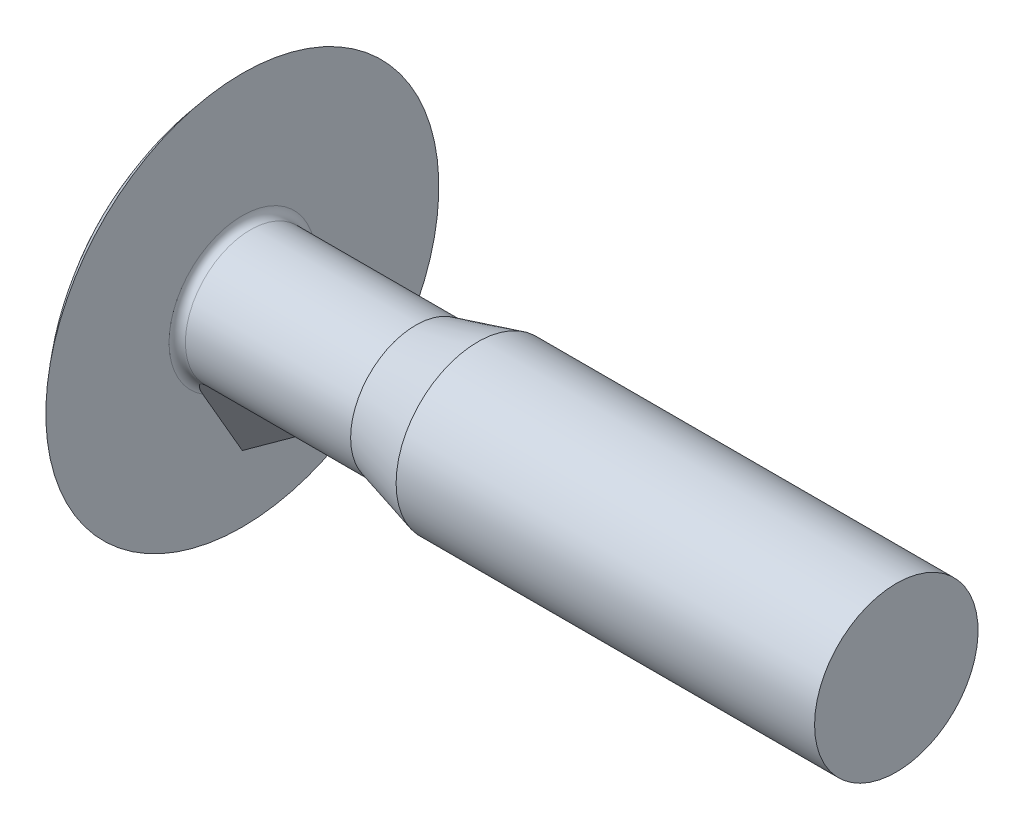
ISO-10303-21;
HEADER;
FILE_DESCRIPTION(('STEP AP214'),'2;1');
FILE_NAME('part.step','',(''),(''),'','','');
FILE_SCHEMA(('AUTOMOTIVE_DESIGN { 1 0 10303 214 1 1 1 1 }'));
ENDSEC;
DATA;
#1=APPLICATION_CONTEXT('core data for automotive mechanical design processes');
#2=APPLICATION_PROTOCOL_DEFINITION('international standard','automotive_design',2000,#1);
#3=PRODUCT_CONTEXT('',#1,'mechanical');
#4=PRODUCT('Part','Part','',(#3));
#5=PRODUCT_RELATED_PRODUCT_CATEGORY('part','',(#4));
#6=PRODUCT_DEFINITION_FORMATION('','',#4);
#7=PRODUCT_DEFINITION_CONTEXT('part definition',#1,'design');
#8=PRODUCT_DEFINITION('design','',#6,#7);
#9=PRODUCT_DEFINITION_SHAPE('','',#8);
#10=(LENGTH_UNIT() NAMED_UNIT(*) SI_UNIT(.MILLI.,.METRE.));
#11=(NAMED_UNIT(*) PLANE_ANGLE_UNIT() SI_UNIT($,.RADIAN.));
#12=(NAMED_UNIT(*) SI_UNIT($,.STERADIAN.) SOLID_ANGLE_UNIT());
#13=UNCERTAINTY_MEASURE_WITH_UNIT(LENGTH_MEASURE(1.E-05),#10,'distance_accuracy_value','');
#14=(GEOMETRIC_REPRESENTATION_CONTEXT(3) GLOBAL_UNCERTAINTY_ASSIGNED_CONTEXT((#13)) GLOBAL_UNIT_ASSIGNED_CONTEXT((#10,
#11,#12)) REPRESENTATION_CONTEXT('',''));
#15=CARTESIAN_POINT('',(0.,0.,0.));
#16=DIRECTION('',(0.,0.,1.));
#17=DIRECTION('',(1.,0.,0.));
#18=AXIS2_PLACEMENT_3D('',#15,#16,#17);
#19=CARTESIAN_POINT('',(4.6,0.,0.));
#20=DIRECTION('',(1.,0.,0.));
#21=DIRECTION('',(0.,1.,0.));
#22=AXIS2_PLACEMENT_3D('',#19,#20,#21);
#23=PLANE('',#22);
#24=CARTESIAN_POINT('',(4.59999999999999,0.,0.));
#25=DIRECTION('',(-1.,0.,0.));
#26=DIRECTION('',(0.,-1.,0.));
#27=AXIS2_PLACEMENT_3D('',#24,#25,#26);
#28=CIRCLE('',#27,12.0183193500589);
#29=CARTESIAN_POINT('',(4.6,-12.0183193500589,0.));
#30=VERTEX_POINT('',#29);
#31=EDGE_CURVE('E87',#30,#30,#28,.T.);
#32=ORIENTED_EDGE('',*,*,#31,.F.);
#33=EDGE_LOOP('',(#32));
#34=FACE_BOUND('',#33,.T.);
#35=CARTESIAN_POINT('',(4.6,0.,0.));
#36=DIRECTION('',(1.,0.,0.));
#37=DIRECTION('',(0.,1.,0.));
#38=AXIS2_PLACEMENT_3D('',#35,#36,#37);
#39=CIRCLE('',#38,4.48179306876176);
#40=CARTESIAN_POINT('',(4.59999999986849,-3.77242531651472,2.41976782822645));
#41=VERTEX_POINT('',#40);
#42=CARTESIAN_POINT('',(4.6,-3.77242531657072,-2.41976782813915));
#43=VERTEX_POINT('',#42);
#44=EDGE_CURVE('E83',#41,#43,#39,.F.);
#45=ORIENTED_EDGE('',*,*,#44,.T.);
#46=DIRECTION('',(0.,0.86602540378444,-0.499999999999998));
#47=VECTOR('',#46,1.);
#48=CARTESIAN_POINT('',(4.59999999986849,-1.99089653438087,-3.44833395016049));
#49=LINE('',#48,#47);
#50=CARTESIAN_POINT('',(4.6,-7.96358613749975,-4.12300402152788E-11));
#51=VERTEX_POINT('',#50);
#52=EDGE_CURVE('E62',#51,#43,#49,.T.);
#53=ORIENTED_EDGE('',*,*,#52,.F.);
#54=DIRECTION('',(0.,-0.866025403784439,-0.499999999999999));
#55=VECTOR('',#54,1.);
#56=CARTESIAN_POINT('',(4.59999999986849,-7.96358613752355,0.));
#57=LINE('',#56,#55);
#58=EDGE_CURVE('E89',#41,#51,#57,.T.);
#59=ORIENTED_EDGE('',*,*,#58,.F.);
#60=EDGE_LOOP('',(#45,#53,#59));
#61=FACE_BOUND('',#60,.T.);
#62=ADVANCED_FACE('F44',(#34,#61),#23,.T.);
#63=CARTESIAN_POINT('',(-22.0180027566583,0.,0.));
#64=DIRECTION('',(-1.,0.,0.));
#65=DIRECTION('',(0.,0.,1.));
#66=AXIS2_PLACEMENT_3D('',#63,#64,#65);
#67=CYLINDRICAL_SURFACE('',#66,3.98179306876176);
#68=CARTESIAN_POINT('',(15.206,0.,0.));
#69=DIRECTION('',(-1.,0.,0.));
#70=DIRECTION('',(0.,0.,1.));
#71=AXIS2_PLACEMENT_3D('',#68,#69,#70);
#72=CIRCLE('',#71,3.98179306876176);
#73=CARTESIAN_POINT('',(15.206,0.,3.98179306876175));
#74=VERTEX_POINT('',#73);
#75=EDGE_CURVE('E142',#74,#74,#72,.T.);
#76=ORIENTED_EDGE('',*,*,#75,.T.);
#77=EDGE_LOOP('',(#76));
#78=FACE_BOUND('',#77,.T.);
#79=CARTESIAN_POINT('',(15.6000000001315,0.,0.));
#80=DIRECTION('',(-0.340368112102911,0.470146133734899,-0.814316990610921));
#81=DIRECTION('',(-0.940292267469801,-0.170184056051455,0.294767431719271));
#82=AXIS2_PLACEMENT_3D('',#79,#80,#81);
#83=ELLIPSE('',#82,11.698490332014,3.98179306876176);
#84=CARTESIAN_POINT('',(5.1,-2.92823023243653,2.69817415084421));
#85=VERTEX_POINT('',#84);
#86=CARTESIAN_POINT('',(10.1,-3.98179306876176,0.));
#87=VERTEX_POINT('',#86);
#88=EDGE_CURVE('E70',#85,#87,#83,.F.);
#89=ORIENTED_EDGE('',*,*,#88,.T.);
#90=CARTESIAN_POINT('',(15.6000000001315,0.,0.));
#91=DIRECTION('',(-0.340368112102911,0.470146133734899,0.814316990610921));
#92=DIRECTION('',(-0.940292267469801,-0.170184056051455,-0.294767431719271));
#93=AXIS2_PLACEMENT_3D('',#90,#91,#92);
#94=ELLIPSE('',#93,11.698490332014,3.98179306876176);
#95=CARTESIAN_POINT('',(5.1,-2.92823023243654,-2.69817415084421));
#96=VERTEX_POINT('',#95);
#97=EDGE_CURVE('E151',#87,#96,#94,.F.);
#98=ORIENTED_EDGE('',*,*,#97,.T.);
#99=CARTESIAN_POINT('',(5.1,0.,0.));
#100=DIRECTION('',(1.,0.,0.));
#101=DIRECTION('',(0.,1.,0.));
#102=AXIS2_PLACEMENT_3D('',#99,#100,#101);
#103=CIRCLE('',#102,3.98179306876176);
#104=EDGE_CURVE('E86',#96,#85,#103,.T.);
#105=ORIENTED_EDGE('',*,*,#104,.T.);
#106=EDGE_LOOP('',(#89,#98,#105));
#107=FACE_BOUND('',#106,.T.);
#108=ADVANCED_FACE('F119',(#78,#107),#67,.T.);
#109=CARTESIAN_POINT('',(5.1,0.,0.));
#110=DIRECTION('',(1.,0.,0.));
#111=DIRECTION('',(0.,1.,0.));
#112=AXIS2_PLACEMENT_3D('',#109,#110,#111);
#113=TOROIDAL_SURFACE('',#112,4.48179306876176,0.5);
#114=CARTESIAN_POINT('',(4.79641919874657,-4.48199306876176,-1.92799942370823));
#115=CARTESIAN_POINT('',(4.77904627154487,-4.45857969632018,-1.94877867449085));
#116=CARTESIAN_POINT('',(4.76308963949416,-4.43416257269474,-1.9695454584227));
#117=CARTESIAN_POINT('',(4.73380687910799,-4.38373895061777,-2.01089715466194));
#118=CARTESIAN_POINT('',(4.7204758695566,-4.3577355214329,-2.03148233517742));
#119=CARTESIAN_POINT('',(4.6962596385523,-4.30464400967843,-2.07225663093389));
#120=CARTESIAN_POINT('',(4.68535872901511,-4.27756429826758,-2.09244747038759));
#121=CARTESIAN_POINT('',(4.66570368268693,-4.22239116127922,-2.13251710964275));
#122=CARTESIAN_POINT('',(4.65695097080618,-4.19429707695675,-2.15239569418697));
#123=CARTESIAN_POINT('',(4.63698380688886,-4.12092333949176,-2.20310391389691));
#124=CARTESIAN_POINT('',(4.62724669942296,-4.07504856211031,-2.23365964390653));
#125=CARTESIAN_POINT('',(4.61224277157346,-3.9818925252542,-2.29371464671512));
#126=CARTESIAN_POINT('',(4.6069782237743,-3.93461056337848,-2.32321337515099));
#127=CARTESIAN_POINT('',(4.60055978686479,-3.83883848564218,-2.38119018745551));
#128=CARTESIAN_POINT('',(4.59942607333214,-3.79034360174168,-2.40966259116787));
#129=CARTESIAN_POINT('',(4.60110679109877,-3.69272553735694,-2.46531990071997));
#130=CARTESIAN_POINT('',(4.60391972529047,-3.64360260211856,-2.49250529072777));
#131=CARTESIAN_POINT('',(4.61453000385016,-3.53336939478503,-2.55171357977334));
#132=CARTESIAN_POINT('',(4.62334290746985,-3.47215360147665,-2.58337291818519));
#133=CARTESIAN_POINT('',(4.6412877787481,-3.3804367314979,-2.62882508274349));
#134=CARTESIAN_POINT('',(4.64803843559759,-3.34994434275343,-2.6436082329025));
#135=CARTESIAN_POINT('',(4.66328169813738,-3.28903358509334,-2.67240369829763));
#136=CARTESIAN_POINT('',(4.67177366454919,-3.25861519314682,-2.68641629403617));
#137=CARTESIAN_POINT('',(4.68860134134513,-3.20499818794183,-2.71033845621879));
#138=CARTESIAN_POINT('',(4.69651872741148,-3.18175728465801,-2.72044728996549));
#139=CARTESIAN_POINT('',(4.71384045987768,-3.13542049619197,-2.73995971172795));
#140=CARTESIAN_POINT('',(4.7232495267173,-3.11232532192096,-2.7493609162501));
#141=CARTESIAN_POINT('',(4.74450661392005,-3.06535377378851,-2.76759491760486));
#142=CARTESIAN_POINT('',(4.75645836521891,-3.04150192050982,-2.77637020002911));
#143=CARTESIAN_POINT('',(4.78332211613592,-2.99489219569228,-2.79205183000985));
#144=CARTESIAN_POINT('',(4.79821581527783,-2.97212859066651,-2.79896913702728));
#145=CARTESIAN_POINT('',(4.82147276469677,-2.94343777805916,-2.80581284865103));
#146=CARTESIAN_POINT('',(4.82774452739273,-2.93622806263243,-2.80735390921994));
#147=CARTESIAN_POINT('',(4.84098870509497,-2.9223405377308,-2.80983607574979));
#148=CARTESIAN_POINT('',(4.84796186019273,-2.91566330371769,-2.81077654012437));
#149=CARTESIAN_POINT('',(4.86278855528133,-2.90304121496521,-2.81186664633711));
#150=CARTESIAN_POINT('',(4.87065294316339,-2.89710777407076,-2.81200516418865));
#151=CARTESIAN_POINT('',(4.88715611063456,-2.88653490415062,-2.81121142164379));
#152=CARTESIAN_POINT('',(4.89579208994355,-2.88189102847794,-2.81028289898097));
#153=CARTESIAN_POINT('',(4.91135868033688,-2.87529302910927,-2.80758573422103));
#154=CARTESIAN_POINT('',(4.91817376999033,-2.87295641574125,-2.80608620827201));
#155=CARTESIAN_POINT('',(4.93190908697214,-2.86936990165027,-2.80241579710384));
#156=CARTESIAN_POINT('',(4.93882931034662,-2.86811996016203,-2.80024493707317));
#157=CARTESIAN_POINT('',(4.95253673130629,-2.8666919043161,-2.79533999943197));
#158=CARTESIAN_POINT('',(4.95932439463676,-2.86650888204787,-2.79260856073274));
#159=CARTESIAN_POINT('',(4.97266156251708,-2.8670732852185,-2.78670803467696));
#160=CARTESIAN_POINT('',(4.97921091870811,-2.86782128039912,-2.78353868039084));
#161=CARTESIAN_POINT('',(4.99677782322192,-2.87092173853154,-2.77440601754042));
#162=CARTESIAN_POINT('',(5.0074864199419,-2.87405462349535,-2.76812126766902));
#163=CARTESIAN_POINT('',(5.02802108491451,-2.88187398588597,-2.75502368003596));
#164=CARTESIAN_POINT('',(5.03784092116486,-2.88657049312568,-2.74820765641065));
#165=CARTESIAN_POINT('',(5.05686740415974,-2.89708006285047,-2.73418726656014));
#166=CARTESIAN_POINT('',(5.06606009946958,-2.90291143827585,-2.72697815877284));
#167=CARTESIAN_POINT('',(5.08364324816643,-2.91522818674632,-2.71251767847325));
#168=CARTESIAN_POINT('',(5.09204439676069,-2.92170124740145,-2.70526894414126));
#169=CARTESIAN_POINT('',(5.10020000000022,-2.92839491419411,-2.69799547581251));
#170=B_SPLINE_CURVE_WITH_KNOTS('',3,(#114,#115,#116,#117,#118,#119,#120,#121,#122,#123,#124,
#125,#126,#127,#128,#129,#130,#131,#132,#133,#134,#135,#136,#137,#138,#139,#140,#141,#142,#143,
#144,#145,#146,#147,#148,#149,#150,#151,#152,#153,#154,#155,#156,#157,#158,#159,#160,#161,#162,
#163,#164,#165,#166,#167,#168,#169),.UNSPECIFIED.,.F.,.F.,(4,2,2,2,2,2,2,2,2,2,2,2,2,2,2,2,2,2,
2,2,2,2,2,2,2,2,2,4),(0.,0.107308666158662,0.2144159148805,0.320810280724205,0.427275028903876,
0.594942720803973,0.762695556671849,0.931266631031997,1.09977377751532,1.30786018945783,
1.41148146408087,1.51506476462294,1.59468516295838,1.67456274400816,1.75872371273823,
1.84237676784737,1.87137161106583,1.90039737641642,1.92982481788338,1.95914949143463,
1.9811193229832,2.00308833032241,2.02495619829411,2.04683745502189,2.08503140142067,
2.12347521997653,2.16260035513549,2.20108298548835),.UNSPECIFIED.);
#171=EDGE_CURVE('E12',#43,#96,#170,.T.);
#172=ORIENTED_EDGE('',*,*,#171,.F.);
#173=ORIENTED_EDGE('',*,*,#44,.F.);
#174=CARTESIAN_POINT('',(5.1002,-2.92839491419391,2.69799547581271));
#175=CARTESIAN_POINT('',(5.09361591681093,-2.92297701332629,2.70387551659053));
#176=CARTESIAN_POINT('',(5.0868810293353,-2.9177276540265,2.70972128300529));
#177=CARTESIAN_POINT('',(5.07296743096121,-2.90763728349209,2.72136256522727));
#178=CARTESIAN_POINT('',(5.06578594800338,-2.90279938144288,2.72715744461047));
#179=CARTESIAN_POINT('',(5.04308794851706,-2.88887251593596,2.74468543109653));
#180=CARTESIAN_POINT('',(5.02677102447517,-2.88068328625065,2.75623363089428));
#181=CARTESIAN_POINT('',(5.00215229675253,-2.8726203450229,2.77117890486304));
#182=CARTESIAN_POINT('',(4.99496380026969,-2.87071186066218,2.77528541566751));
#183=CARTESIAN_POINT('',(4.98020446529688,-2.86791265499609,2.78307064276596));
#184=CARTESIAN_POINT('',(4.9726358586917,-2.86701658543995,2.78675151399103));
#185=CARTESIAN_POINT('',(4.95706205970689,-2.86647782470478,2.79357210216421));
#186=CARTESIAN_POINT('',(4.94905199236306,-2.86685431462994,2.79670278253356));
#187=CARTESIAN_POINT('',(4.93295581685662,-2.86909569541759,2.80213659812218));
#188=CARTESIAN_POINT('',(4.92486978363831,-2.87095924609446,2.80444047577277));
#189=CARTESIAN_POINT('',(4.90994531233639,-2.87580991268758,2.80787807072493));
#190=CARTESIAN_POINT('',(4.90307642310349,-2.87862922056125,2.80912140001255));
#191=CARTESIAN_POINT('',(4.88970822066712,-2.88520953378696,2.8109098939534));
#192=CARTESIAN_POINT('',(4.88320935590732,-2.88897165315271,2.8114542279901));
#193=CARTESIAN_POINT('',(4.86783042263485,-2.89909274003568,2.81203890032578));
#194=CARTESIAN_POINT('',(4.85920650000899,-2.90585577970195,2.81173888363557));
#195=CARTESIAN_POINT('',(4.84292324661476,-2.92035491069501,2.81017387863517));
#196=CARTESIAN_POINT('',(4.83526667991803,-2.92809366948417,2.80890619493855));
#197=CARTESIAN_POINT('',(4.81405614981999,-2.95162291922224,2.80418715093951));
#198=CARTESIAN_POINT('',(4.80162444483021,-2.96821991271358,2.79980107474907));
#199=CARTESIAN_POINT('',(4.77888148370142,-3.00237112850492,2.78958996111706));
#200=CARTESIAN_POINT('',(4.76857739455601,-3.01992834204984,2.78376020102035));
#201=CARTESIAN_POINT('',(4.74389120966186,-3.06598304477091,2.7674888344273));
#202=CARTESIAN_POINT('',(4.73066851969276,-3.09484951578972,2.75634958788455));
#203=CARTESIAN_POINT('',(4.70679581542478,-3.15309922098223,2.73269741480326));
#204=CARTESIAN_POINT('',(4.6961514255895,-3.18248343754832,2.72018157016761));
#205=CARTESIAN_POINT('',(4.67682495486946,-3.24163592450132,2.69410794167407));
#206=CARTESIAN_POINT('',(4.66815372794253,-3.27140541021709,2.68054491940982));
#207=CARTESIAN_POINT('',(4.65253539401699,-3.33100106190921,2.6526655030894));
#208=CARTESIAN_POINT('',(4.64558684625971,-3.36082715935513,2.63834975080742));
#209=CARTESIAN_POINT('',(4.6279307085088,-3.44601038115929,2.5965491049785));
#210=CARTESIAN_POINT('',(4.61909388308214,-3.50137665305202,2.56827698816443));
#211=CARTESIAN_POINT('',(4.6062608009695,-3.61175199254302,2.50991572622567));
#212=CARTESIAN_POINT('',(4.60226866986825,-3.66676071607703,2.47982505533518));
#213=CARTESIAN_POINT('',(4.59919117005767,-3.77563962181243,2.41825012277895));
#214=CARTESIAN_POINT('',(4.60007221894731,-3.82951503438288,2.38677687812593));
#215=CARTESIAN_POINT('',(4.60694819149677,-3.93605984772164,2.32238918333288));
#216=CARTESIAN_POINT('',(4.61294128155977,-3.98872967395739,2.28947525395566));
#217=CARTESIAN_POINT('',(4.62852581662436,-4.08048025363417,2.22998901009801));
#218=CARTESIAN_POINT('',(4.63698664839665,-4.11992355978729,2.20367994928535));
#219=CARTESIAN_POINT('',(4.65754964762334,-4.19733504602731,2.15039148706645));
#220=CARTESIAN_POINT('',(4.66964813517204,-4.23530467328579,2.12341278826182));
#221=CARTESIAN_POINT('',(4.69803321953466,-4.30970531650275,2.06859316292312));
#222=CARTESIAN_POINT('',(4.71436220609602,-4.34611614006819,2.04074617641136));
#223=CARTESIAN_POINT('',(4.74234878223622,-4.39873093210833,1.99867118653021));
#224=CARTESIAN_POINT('',(4.75227982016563,-4.4159633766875,1.98457105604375));
#225=CARTESIAN_POINT('',(4.77339210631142,-4.449620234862,1.95631474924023));
#226=CARTESIAN_POINT('',(4.78457424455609,-4.46604406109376,1.94215854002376));
#227=CARTESIAN_POINT('',(4.79641919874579,-4.48199306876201,1.92799942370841));
#228=B_SPLINE_CURVE_WITH_KNOTS('',3,(#174,#175,#176,#177,#178,#179,#180,#181,#182,#183,#184,
#185,#186,#187,#188,#189,#190,#191,#192,#193,#194,#195,#196,#197,#198,#199,#200,#201,#202,#203,
#204,#205,#206,#207,#208,#209,#210,#211,#212,#213,#214,#215,#216,#217,#218,#219,#220,#221,#222,
#223,#224,#225,#226,#227),.UNSPECIFIED.,.F.,.F.,(4,2,2,2,2,2,2,2,2,2,2,2,2,2,2,2,2,2,2,2,2,2,2,
2,2,2,4),(0.,0.0310422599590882,0.0623013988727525,0.126538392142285,0.151966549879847,
0.177259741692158,0.202935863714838,0.228588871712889,0.251063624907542,0.273565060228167,
0.306267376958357,0.339061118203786,0.402292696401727,0.465733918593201,0.566436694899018,
0.667357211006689,0.768820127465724,0.87019789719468,1.05831831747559,1.24659882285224,
1.43358346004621,1.6205010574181,1.76484149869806,1.90903641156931,2.05473615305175,
2.12783654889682,2.20098928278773),.UNSPECIFIED.);
#229=EDGE_CURVE('E54',#85,#41,#228,.T.);
#230=ORIENTED_EDGE('',*,*,#229,.F.);
#231=ORIENTED_EDGE('',*,*,#104,.F.);
#232=EDGE_LOOP('',(#172,#173,#230,#231));
#233=FACE_BOUND('',#232,.T.);
#234=ADVANCED_FACE('F46',(#233),#113,.F.);
#235=CARTESIAN_POINT('',(18.,0.,0.));
#236=DIRECTION('',(-1.,0.,0.));
#237=DIRECTION('',(0.,1.,0.));
#238=AXIS2_PLACEMENT_3D('',#235,#236,#237);
#239=SPHERICAL_SURFACE('',#238,18.);
#240=ORIENTED_EDGE('',*,*,#31,.T.);
#241=EDGE_LOOP('',(#240));
#242=FACE_BOUND('',#241,.T.);
#243=ADVANCED_FACE('F117',(#242),#239,.T.);
#244=CARTESIAN_POINT('',(15.206,0.,0.));
#245=DIRECTION('',(1.,0.,0.));
#246=DIRECTION('',(0.,0.,-1.));
#247=AXIS2_PLACEMENT_3D('',#244,#245,#246);
#248=CONICAL_SURFACE('',#247,3.98179306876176,0.261799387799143);
#249=CARTESIAN_POINT('',(19.006,0.,0.));
#250=DIRECTION('',(-1.,0.,0.));
#251=DIRECTION('',(0.,0.,1.));
#252=AXIS2_PLACEMENT_3D('',#249,#250,#251);
#253=CIRCLE('',#252,4.99999999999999);
#254=CARTESIAN_POINT('',(19.006,0.,4.99999999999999));
#255=VERTEX_POINT('',#254);
#256=EDGE_CURVE('E148',#255,#255,#253,.T.);
#257=ORIENTED_EDGE('',*,*,#256,.T.);
#258=EDGE_LOOP('',(#257));
#259=FACE_BOUND('',#258,.T.);
#260=ORIENTED_EDGE('',*,*,#75,.F.);
#261=EDGE_LOOP('',(#260));
#262=FACE_BOUND('',#261,.T.);
#263=ADVANCED_FACE('F113',(#259,#262),#248,.T.);
#264=CARTESIAN_POINT('',(44.6,0.,0.));
#265=DIRECTION('',(1.,0.,0.));
#266=DIRECTION('',(0.,1.,0.));
#267=AXIS2_PLACEMENT_3D('',#264,#265,#266);
#268=PLANE('',#267);
#269=CARTESIAN_POINT('',(44.6,0.,0.));
#270=DIRECTION('',(1.,0.,0.));
#271=DIRECTION('',(0.,1.,0.));
#272=AXIS2_PLACEMENT_3D('',#269,#270,#271);
#273=CIRCLE('',#272,5.);
#274=CARTESIAN_POINT('',(44.6,5.00000000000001,0.));
#275=VERTEX_POINT('',#274);
#276=EDGE_CURVE('E139',#275,#275,#273,.T.);
#277=ORIENTED_EDGE('',*,*,#276,.T.);
#278=EDGE_LOOP('',(#277));
#279=FACE_BOUND('',#278,.T.);
#280=ADVANCED_FACE('F116',(#279),#268,.T.);
#281=CARTESIAN_POINT('',(44.6,0.,0.));
#282=DIRECTION('',(-1.,0.,0.));
#283=DIRECTION('',(0.,-1.,0.));
#284=AXIS2_PLACEMENT_3D('',#281,#282,#283);
#285=CYLINDRICAL_SURFACE('',#284,5.);
#286=ORIENTED_EDGE('',*,*,#276,.F.);
#287=EDGE_LOOP('',(#286));
#288=FACE_BOUND('',#287,.T.);
#289=ORIENTED_EDGE('',*,*,#256,.F.);
#290=EDGE_LOOP('',(#289));
#291=FACE_BOUND('',#290,.T.);
#292=ADVANCED_FACE('F125',(#288,#291),#285,.T.);
#293=CARTESIAN_POINT('',(10.1,-3.98179306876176,0.));
#294=DIRECTION('',(-0.340368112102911,0.470146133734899,0.814316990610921));
#295=DIRECTION('',(0.,-0.86602540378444,0.499999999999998));
#296=AXIS2_PLACEMENT_3D('',#293,#294,#295);
#297=PLANE('',#296);
#298=ORIENTED_EDGE('',*,*,#97,.F.);
#299=DIRECTION('',(0.810009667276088,0.586416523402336,0.));
#300=VECTOR('',#299,1.);
#301=CARTESIAN_POINT('',(4.59999999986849,-7.96358613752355,0.));
#302=LINE('',#301,#300);
#303=EDGE_CURVE('E93',#51,#87,#302,.T.);
#304=ORIENTED_EDGE('',*,*,#303,.F.);
#305=ORIENTED_EDGE('',*,*,#52,.T.);
#306=ORIENTED_EDGE('',*,*,#171,.T.);
#307=EDGE_LOOP('',(#298,#304,#305,#306));
#308=FACE_BOUND('',#307,.T.);
#309=ADVANCED_FACE('F111',(#308),#297,.F.);
#310=CARTESIAN_POINT('',(10.1,-3.98179306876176,0.));
#311=DIRECTION('',(-0.340368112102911,0.470146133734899,-0.814316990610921));
#312=DIRECTION('',(0.,0.866025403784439,0.499999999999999));
#313=AXIS2_PLACEMENT_3D('',#310,#311,#312);
#314=PLANE('',#313);
#315=ORIENTED_EDGE('',*,*,#88,.F.);
#316=ORIENTED_EDGE('',*,*,#229,.T.);
#317=ORIENTED_EDGE('',*,*,#58,.T.);
#318=ORIENTED_EDGE('',*,*,#303,.T.);
#319=EDGE_LOOP('',(#315,#316,#317,#318));
#320=FACE_BOUND('',#319,.T.);
#321=ADVANCED_FACE('F95',(#320),#314,.F.);
#322=CLOSED_SHELL('',(#62,#108,#234,#243,#263,#280,#292,#309,#321));
#323=MANIFOLD_SOLID_BREP('B2',#322);
#324=ADVANCED_BREP_SHAPE_REPRESENTATION('',(#18,#323),#14);
#325=SHAPE_DEFINITION_REPRESENTATION(#9,#324);
ENDSEC;
END-ISO-10303-21;
